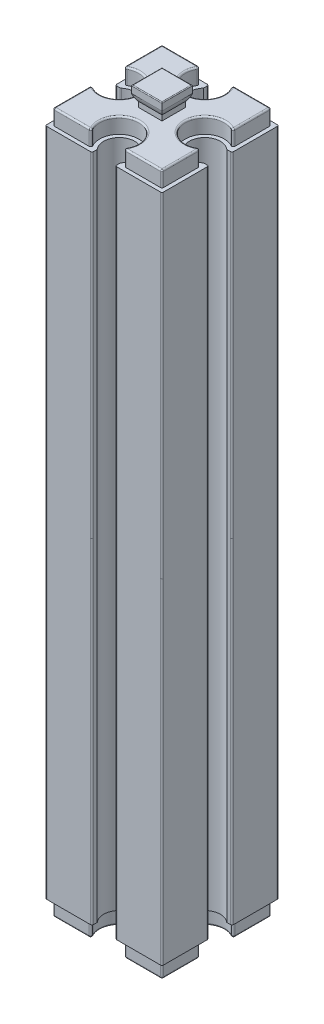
from build123d import *

# Parameters (mm, degrees)
EXTRUDE_1_DEPTH        = 43
EXTRUDE_2_DEPTH        = 2
EXTRUDE_3_DEPTH        = 2
FILLET_3_R             = 0.2
CUT_EXTRUDE_1_DEPTH    = 3
FILLET_4_R             = 0.2
FILLET_5_R             = 0.1
FILLET_3_OF_MIRROR_1_R = 0.2
FILLET_4_OF_MIRROR_1_R = 0.2
FILLET_5_OF_MIRROR_1_R = 0.1


with BuildPart() as part:
    # Sketch 1 → Extrude 1 (new body)
    with BuildSketch(Plane(origin=(0, 0, 0), x_dir=(1, 0, 0), z_dir=(0, 1, 0))):
        with BuildLine():
            Line((-7.5, 7.5), (-1.5, 7.5))
            Line((-1.5, 7.5), (-1.5, 6.822875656))
            ThreePointArc((-1.5, 6.822875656), (0, 3.5), (1.5, 6.822875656))
            Line((1.5, 6.822875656), (1.5, 7.5))
            Line((1.5, 7.5), (7.5, 7.5))
            Line((7.5, 7.5), (7.5, 1.5))
            Line((7.5, 1.5), (6.822875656, 1.5))
            ThreePointArc((6.822875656, 1.5), (3.5, 0), (6.822875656, -1.5))
            Line((6.822875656, -1.5), (7.5, -1.5))
            Line((7.5, -1.5), (7.5, -7.5))
            Line((7.5, -7.5), (1.5, -7.5))
            Line((1.5, -7.5), (1.5, -6.822875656))
            ThreePointArc((1.5, -6.822875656), (0, -3.5), (-1.5, -6.822875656))
            Line((-1.5, -6.822875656), (-1.5, -7.5))
            Line((-1.5, -7.5), (-7.5, -7.5))
            Line((-7.5, -7.5), (-7.5, -1.5))
            Line((-7.5, -1.5), (-6.822875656, -1.5))
            ThreePointArc((-6.822875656, -1.5), (-3.5, 0), (-6.822875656, 1.5))
            Line((-6.822875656, 1.5), (-7.5, 1.5))
            Line((-7.5, 1.5), (-7.5, 7.5))
        make_face()
    extrude_1 = extrude(amount=EXTRUDE_1_DEPTH)

    # Sketch 2 → Extrude 2 (add)
    with BuildSketch(Plane(origin=(0, 43, 0), x_dir=(1, 0, 0), z_dir=(0, 1, 0))):
        with BuildLine():
            Line((-7, 7), (-7, 2))
            ThreePointArc((-7, 2), (-3, 0), (-7, -2))
            Line((-7, -2), (-7, -7))
            Line((-7, -7), (-2, -7))
            ThreePointArc((-2, -7), (0, -3), (2, -7))
            Line((2, -7), (7, -7))
            Line((7, -7), (7, -2))
            ThreePointArc((7, -2), (3, 0), (7, 2))
            Line((7, 2), (7, 7))
            Line((7, 7), (2, 7))
            ThreePointArc((2, 7), (0, 3), (-2, 7))
            Line((-2, 7), (-7, 7))
        make_face()
    extrude_2 = extrude(amount=EXTRUDE_2_DEPTH)

    # Sketch 3 → Extrude 3 (add, symmetric)
    with BuildSketch(Plane(origin=(0, 0, 0), x_dir=(0, 0, -1), z_dir=(1, 0, 0))):
        with BuildLine():
            Line((-1.5, 45), (1.5, 45))
            Line((1.5, 45), (1.5, 45.677124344))
            ThreePointArc((1.5, 45.677124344), (1.780042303, 46.088161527), (1.95, 46.555590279))
            Line((1.95, 46.555590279), (1.95, 47.5))
            Line((1.95, 47.5), (-1.95, 47.5))
            Line((-1.95, 47.5), (-1.95, 46.555590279))
            ThreePointArc((-1.95, 46.555590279), (-1.780042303, 46.088161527), (-1.5, 45.677124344))
            Line((-1.5, 45.677124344), (-1.5, 45))
        make_face()
    extrude_3 = extrude(amount=EXTRUDE_3_DEPTH, both=True)

    # Fillet 3
    fillet_3_edges = [part.edges().sort_by_distance(p)[0] for p in [
        (-7.5, 21.5, -7.5),
        (-1.5, 21.5, -7.5),
        (1.5, 21.5, -7.5),
        (7.5, 21.5, -7.5),
        (7.5, 21.5, -1.5),
        (7.5, 21.5, 1.5),
        (7.5, 21.5, 7.5),
        (1.5, 21.5, 7.5),
        (-1.5, 21.5, 7.5),
        (-7.5, 21.5, 7.5),
        (-7.5, 21.5, 1.5),
        (-6.822875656, 21.5, -1.5),
        (-7.5, 21.5, -1.5),
    ]]
    fillet(fillet_3_edges, radius=FILLET_3_R)

    # Sketch 4 → Cut-Extrude 1 (cut, symmetric)
    with BuildSketch(Plane.XY):
        with BuildLine():
            Line((1.95, 47.5), (2, 47.5))
            Line((2, 47.5), (2, 45))
            Line((2, 45), (1.5, 45))
            Line((1.5, 45), (1.5, 45.677124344))
            ThreePointArc((1.5, 45.677124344), (1.780042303, 46.088161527), (1.95, 46.555590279))
            Line((1.95, 46.555590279), (1.95, 47.5))
        make_face()
        with BuildLine():
            Line((-1.95, 47.5), (-1.95, 46.555590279))
            ThreePointArc((-1.95, 46.555590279), (-1.780042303, 46.088161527), (-1.5, 45.677124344))
            Line((-1.5, 45.677124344), (-1.5, 45))
            Line((-1.5, 45), (-2, 45))
            Line((-2, 45), (-2, 47.5))
            Line((-2, 47.5), (-1.95, 47.5))
        make_face()
    cut_extrude_1 = extrude(amount=CUT_EXTRUDE_1_DEPTH, both=True, mode=Mode.SUBTRACT)

    # Fillet 4
    fillet_4_edges = [part.edges().sort_by_distance(p)[0] for p in [
        (-2, 44, -7),
        (-7, 44, -7),
        (-7, 44, -2),
        (-7, 44, 2),
        (-7, 44, 7),
        (-2, 44, 7),
        (2, 44, 7),
        (7, 44, 7),
        (7, 44, 2),
        (7, 44, -2),
        (7, 44, -7),
        (2, 44, -7),
        (-4.5, 45, -7),
        (-7, 45, -4.5),
        (-3, 45, 0),
        (-7, 45, 4.5),
        (-4.5, 45, 7),
        (0, 45, 3),
        (4.5, 45, 7),
        (7, 45, 4.5),
        (3, 45, 0),
        (7, 45, -4.5),
        (4.5, 45, -7),
        (0, 45, -3),
    ]]
    fillet(fillet_4_edges, radius=FILLET_4_R)

    # Fillet 5
    fillet_5_edges = [part.edges().sort_by_distance(p)[0] for p in [
        (1.95, 47.5, 0),
        (0, 47.5, -1.95),
        (0, 47.5, 1.95),
        (-1.95, 47.5, 0),
    ]]
    fillet(fillet_5_edges, radius=FILLET_5_R)


with BuildPart() as mirror_1_1:
    # Mirror 1: Extrude 1, Extrude 2, Extrude 3 across Top Plane
    add(extrude_1.mirror(Plane(origin=(0, 0, 0), x_dir=(1, 0, 0), z_dir=(0, 1, 0))))
    add(extrude_2.mirror(Plane(origin=(0, 0, 0), x_dir=(1, 0, 0), z_dir=(0, 1, 0))))
    add(extrude_3.mirror(Plane(origin=(0, 0, 0), x_dir=(1, 0, 0), z_dir=(0, 1, 0))))

    # Mirror 1 2: Cut-Extrude 1 across Top Plane
    add(cut_extrude_1.mirror(Plane(origin=(0, 0, 0), x_dir=(1, 0, 0), z_dir=(0, 1, 0))), mode=Mode.SUBTRACT)

    # Fillet 3 of Mirror 1
    fillet_3_of_mirror_1_edges = [mirror_1_1.edges().sort_by_distance(p)[0] for p in [
        (-7.5, -21.5, -7.5),
        (-1.5, -21.5, -7.5),
        (1.5, -21.5, -7.5),
        (7.5, -21.5, -7.5),
        (7.5, -21.5, -1.5),
        (7.5, -21.5, 1.5),
        (7.5, -21.5, 7.5),
        (1.5, -21.5, 7.5),
        (-1.5, -21.5, 7.5),
        (-7.5, -21.5, 7.5),
        (-7.5, -21.5, 1.5),
        (-6.822875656, -21.5, -1.5),
        (-7.5, -21.5, -1.5),
    ]]
    fillet(fillet_3_of_mirror_1_edges, radius=FILLET_3_OF_MIRROR_1_R)

    # Fillet 4 of Mirror 1
    fillet_4_of_mirror_1_edges = [mirror_1_1.edges().sort_by_distance(p)[0] for p in [
        (-2, -44, -7),
        (-7, -44, -7),
        (-7, -44, -2),
        (-7, -44, 2),
        (-7, -44, 7),
        (-2, -44, 7),
        (2, -44, 7),
        (7, -44, 7),
        (7, -44, 2),
        (7, -44, -2),
        (7, -44, -7),
        (2, -44, -7),
        (-4.5, -45, -7),
        (-7, -45, -4.5),
        (-3, -45, 0),
        (-7, -45, 4.5),
        (-4.5, -45, 7),
        (0, -45, 3),
        (4.5, -45, 7),
        (7, -45, 4.5),
        (3, -45, 0),
        (7, -45, -4.5),
        (4.5, -45, -7),
        (0, -45, -3),
    ]]
    fillet(fillet_4_of_mirror_1_edges, radius=FILLET_4_OF_MIRROR_1_R)

    # Fillet 5 of Mirror 1
    fillet_5_of_mirror_1_edges = [mirror_1_1.edges().sort_by_distance(p)[0] for p in [
        (1.95, -47.5, 0),
        (0, -47.5, -1.95),
        (0, -47.5, 1.95),
        (-1.95, -47.5, 0),
    ]]
    fillet(fillet_5_of_mirror_1_edges, radius=FILLET_5_OF_MIRROR_1_R)


with BuildPart() as part_1:
    add(part.part)

    # Mirror 1 united with what the copies tou: union Mirror 1_1
    add(mirror_1_1.part)


solid = part_1.part
